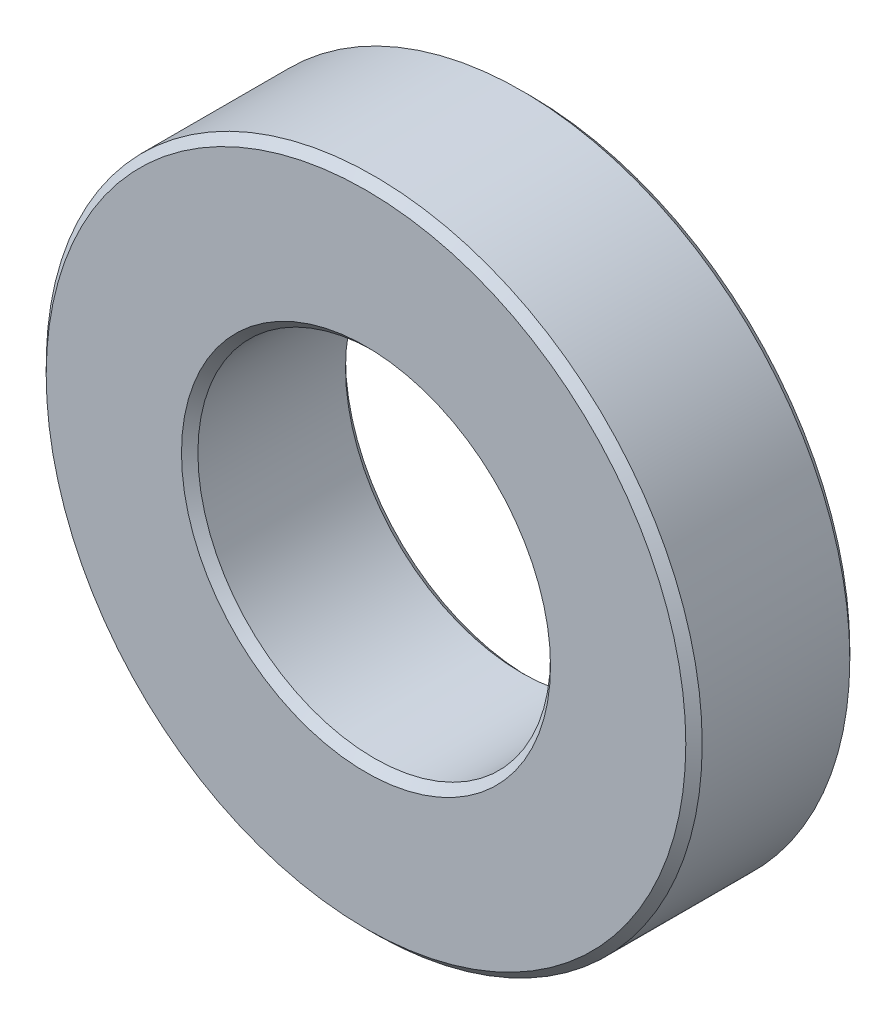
ISO-10303-21;
HEADER;
FILE_DESCRIPTION(('STEP AP214'),'2;1');
FILE_NAME('part.step','',(''),(''),'','','');
FILE_SCHEMA(('AUTOMOTIVE_DESIGN { 1 0 10303 214 1 1 1 1 }'));
ENDSEC;
DATA;
#1=APPLICATION_CONTEXT('core data for automotive mechanical design processes');
#2=APPLICATION_PROTOCOL_DEFINITION('international standard','automotive_design',2000,#1);
#3=PRODUCT_CONTEXT('',#1,'mechanical');
#4=PRODUCT('Part','Part','',(#3));
#5=PRODUCT_RELATED_PRODUCT_CATEGORY('part','',(#4));
#6=PRODUCT_DEFINITION_FORMATION('','',#4);
#7=PRODUCT_DEFINITION_CONTEXT('part definition',#1,'design');
#8=PRODUCT_DEFINITION('design','',#6,#7);
#9=PRODUCT_DEFINITION_SHAPE('','',#8);
#10=(LENGTH_UNIT() NAMED_UNIT(*) SI_UNIT(.MILLI.,.METRE.));
#11=(NAMED_UNIT(*) PLANE_ANGLE_UNIT() SI_UNIT($,.RADIAN.));
#12=(NAMED_UNIT(*) SI_UNIT($,.STERADIAN.) SOLID_ANGLE_UNIT());
#13=UNCERTAINTY_MEASURE_WITH_UNIT(LENGTH_MEASURE(1.E-05),#10,'distance_accuracy_value','');
#14=(GEOMETRIC_REPRESENTATION_CONTEXT(3) GLOBAL_UNCERTAINTY_ASSIGNED_CONTEXT((#13)) GLOBAL_UNIT_ASSIGNED_CONTEXT((#10,
#11,#12)) REPRESENTATION_CONTEXT('',''));
#15=CARTESIAN_POINT('',(0.,0.,0.));
#16=DIRECTION('',(0.,0.,1.));
#17=DIRECTION('',(1.,0.,0.));
#18=AXIS2_PLACEMENT_3D('',#15,#16,#17);
#19=CARTESIAN_POINT('',(0.,0.,1.));
#20=DIRECTION('',(0.,0.,1.));
#21=DIRECTION('',(1.,0.,0.));
#22=AXIS2_PLACEMENT_3D('',#19,#20,#21);
#23=PLANE('',#22);
#24=CARTESIAN_POINT('',(0.,0.,1.));
#25=DIRECTION('',(0.,0.,1.));
#26=DIRECTION('',(1.,0.,0.));
#27=AXIS2_PLACEMENT_3D('',#24,#25,#26);
#28=CIRCLE('',#27,2.25);
#29=CARTESIAN_POINT('',(2.25,0.,1.));
#30=VERTEX_POINT('',#29);
#31=EDGE_CURVE('E10',#30,#30,#28,.F.);
#32=ORIENTED_EDGE('',*,*,#31,.T.);
#33=EDGE_LOOP('',(#32));
#34=FACE_BOUND('',#33,.T.);
#35=CARTESIAN_POINT('',(0.,0.,1.));
#36=DIRECTION('',(0.,0.,1.));
#37=DIRECTION('',(1.,0.,0.));
#38=AXIS2_PLACEMENT_3D('',#35,#36,#37);
#39=CIRCLE('',#38,3.9);
#40=CARTESIAN_POINT('',(3.9,0.,1.));
#41=VERTEX_POINT('',#40);
#42=EDGE_CURVE('E45',#41,#41,#39,.T.);
#43=ORIENTED_EDGE('',*,*,#42,.T.);
#44=EDGE_LOOP('',(#43));
#45=FACE_BOUND('',#44,.T.);
#46=ADVANCED_FACE('F37',(#34,#45),#23,.T.);
#47=CARTESIAN_POINT('',(0.,0.,-1.));
#48=DIRECTION('',(0.,0.,1.));
#49=DIRECTION('',(1.,0.,0.));
#50=AXIS2_PLACEMENT_3D('',#47,#48,#49);
#51=PLANE('',#50);
#52=CARTESIAN_POINT('',(0.,0.,-1.));
#53=DIRECTION('',(0.,0.,1.));
#54=DIRECTION('',(1.,0.,0.));
#55=AXIS2_PLACEMENT_3D('',#52,#53,#54);
#56=CIRCLE('',#55,3.9);
#57=CARTESIAN_POINT('',(3.9,0.,-1.));
#58=VERTEX_POINT('',#57);
#59=EDGE_CURVE('E62',#58,#58,#56,.F.);
#60=ORIENTED_EDGE('',*,*,#59,.T.);
#61=EDGE_LOOP('',(#60));
#62=FACE_BOUND('',#61,.T.);
#63=CARTESIAN_POINT('',(0.,0.,-1.));
#64=DIRECTION('',(0.,0.,1.));
#65=DIRECTION('',(1.,0.,0.));
#66=AXIS2_PLACEMENT_3D('',#63,#64,#65);
#67=CIRCLE('',#66,2.25);
#68=CARTESIAN_POINT('',(2.25,0.,-1.));
#69=VERTEX_POINT('',#68);
#70=EDGE_CURVE('E66',#69,#69,#67,.T.);
#71=ORIENTED_EDGE('',*,*,#70,.T.);
#72=EDGE_LOOP('',(#71));
#73=FACE_BOUND('',#72,.T.);
#74=ADVANCED_FACE('F89',(#62,#73),#51,.F.);
#75=CARTESIAN_POINT('',(0.,0.,1.));
#76=DIRECTION('',(0.,0.,-1.));
#77=DIRECTION('',(-1.,0.,0.));
#78=AXIS2_PLACEMENT_3D('',#75,#76,#77);
#79=CYLINDRICAL_SURFACE('',#78,4.);
#80=CARTESIAN_POINT('',(0.,0.,-0.9));
#81=DIRECTION('',(0.,0.,1.));
#82=DIRECTION('',(1.,0.,0.));
#83=AXIS2_PLACEMENT_3D('',#80,#81,#82);
#84=CIRCLE('',#83,4.);
#85=CARTESIAN_POINT('',(4.,0.,-0.9));
#86=VERTEX_POINT('',#85);
#87=EDGE_CURVE('E70',#86,#86,#84,.T.);
#88=ORIENTED_EDGE('',*,*,#87,.T.);
#89=EDGE_LOOP('',(#88));
#90=FACE_BOUND('',#89,.T.);
#91=CARTESIAN_POINT('',(0.,0.,0.900000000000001));
#92=DIRECTION('',(0.,0.,1.));
#93=DIRECTION('',(1.,0.,0.));
#94=AXIS2_PLACEMENT_3D('',#91,#92,#93);
#95=CIRCLE('',#94,4.);
#96=CARTESIAN_POINT('',(4.,0.,0.900000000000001));
#97=VERTEX_POINT('',#96);
#98=EDGE_CURVE('E74',#97,#97,#95,.F.);
#99=ORIENTED_EDGE('',*,*,#98,.T.);
#100=EDGE_LOOP('',(#99));
#101=FACE_BOUND('',#100,.T.);
#102=ADVANCED_FACE('F78',(#90,#101),#79,.T.);
#103=CARTESIAN_POINT('',(0.,0.,1.));
#104=DIRECTION('',(0.,0.,-1.));
#105=DIRECTION('',(-1.,0.,0.));
#106=AXIS2_PLACEMENT_3D('',#103,#104,#105);
#107=CYLINDRICAL_SURFACE('',#106,2.15);
#108=CARTESIAN_POINT('',(0.,0.,-0.900000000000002));
#109=DIRECTION('',(0.,0.,1.));
#110=DIRECTION('',(1.,0.,0.));
#111=AXIS2_PLACEMENT_3D('',#108,#109,#110);
#112=CIRCLE('',#111,2.15);
#113=CARTESIAN_POINT('',(2.15,0.,-0.900000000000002));
#114=VERTEX_POINT('',#113);
#115=EDGE_CURVE('E51',#114,#114,#112,.F.);
#116=ORIENTED_EDGE('',*,*,#115,.T.);
#117=EDGE_LOOP('',(#116));
#118=FACE_BOUND('',#117,.T.);
#119=CARTESIAN_POINT('',(0.,0.,0.899999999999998));
#120=DIRECTION('',(0.,0.,1.));
#121=DIRECTION('',(1.,0.,0.));
#122=AXIS2_PLACEMENT_3D('',#119,#120,#121);
#123=CIRCLE('',#122,2.15);
#124=CARTESIAN_POINT('',(2.15,0.,0.899999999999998));
#125=VERTEX_POINT('',#124);
#126=EDGE_CURVE('E56',#125,#125,#123,.T.);
#127=ORIENTED_EDGE('',*,*,#126,.T.);
#128=EDGE_LOOP('',(#127));
#129=FACE_BOUND('',#128,.T.);
#130=ADVANCED_FACE('F97',(#118,#129),#107,.F.);
#131=CARTESIAN_POINT('',(0.,0.,-0.9));
#132=DIRECTION('',(0.,0.,1.));
#133=DIRECTION('',(1.,0.,0.));
#134=AXIS2_PLACEMENT_3D('',#131,#132,#133);
#135=CONICAL_SURFACE('',#134,4.,0.785398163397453);
#136=ORIENTED_EDGE('',*,*,#59,.F.);
#137=EDGE_LOOP('',(#136));
#138=FACE_BOUND('',#137,.T.);
#139=ORIENTED_EDGE('',*,*,#87,.F.);
#140=EDGE_LOOP('',(#139));
#141=FACE_BOUND('',#140,.T.);
#142=ADVANCED_FACE('F102',(#138,#141),#135,.T.);
#143=CARTESIAN_POINT('',(0.,0.,-1.));
#144=DIRECTION('',(0.,0.,-1.));
#145=DIRECTION('',(-1.,0.,0.));
#146=AXIS2_PLACEMENT_3D('',#143,#144,#145);
#147=CONICAL_SURFACE('',#146,2.25,0.785398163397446);
#148=ORIENTED_EDGE('',*,*,#115,.F.);
#149=EDGE_LOOP('',(#148));
#150=FACE_BOUND('',#149,.T.);
#151=ORIENTED_EDGE('',*,*,#70,.F.);
#152=EDGE_LOOP('',(#151));
#153=FACE_BOUND('',#152,.T.);
#154=ADVANCED_FACE('F86',(#150,#153),#147,.F.);
#155=CARTESIAN_POINT('',(0.,0.,0.899999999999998));
#156=DIRECTION('',(0.,0.,1.));
#157=DIRECTION('',(1.,0.,0.));
#158=AXIS2_PLACEMENT_3D('',#155,#156,#157);
#159=CONICAL_SURFACE('',#158,2.15,0.785398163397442);
#160=ORIENTED_EDGE('',*,*,#31,.F.);
#161=EDGE_LOOP('',(#160));
#162=FACE_BOUND('',#161,.T.);
#163=ORIENTED_EDGE('',*,*,#126,.F.);
#164=EDGE_LOOP('',(#163));
#165=FACE_BOUND('',#164,.T.);
#166=ADVANCED_FACE('F82',(#162,#165),#159,.F.);
#167=CARTESIAN_POINT('',(0.,0.,1.));
#168=DIRECTION('',(0.,0.,-1.));
#169=DIRECTION('',(-1.,0.,0.));
#170=AXIS2_PLACEMENT_3D('',#167,#168,#169);
#171=CONICAL_SURFACE('',#170,3.9,0.785398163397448);
#172=ORIENTED_EDGE('',*,*,#98,.F.);
#173=EDGE_LOOP('',(#172));
#174=FACE_BOUND('',#173,.T.);
#175=ORIENTED_EDGE('',*,*,#42,.F.);
#176=EDGE_LOOP('',(#175));
#177=FACE_BOUND('',#176,.T.);
#178=ADVANCED_FACE('F39',(#174,#177),#171,.T.);
#179=CLOSED_SHELL('',(#46,#74,#102,#130,#142,#154,#166,#178));
#180=MANIFOLD_SOLID_BREP('B2',#179);
#181=ADVANCED_BREP_SHAPE_REPRESENTATION('',(#18,#180),#14);
#182=SHAPE_DEFINITION_REPRESENTATION(#9,#181);
ENDSEC;
END-ISO-10303-21;
